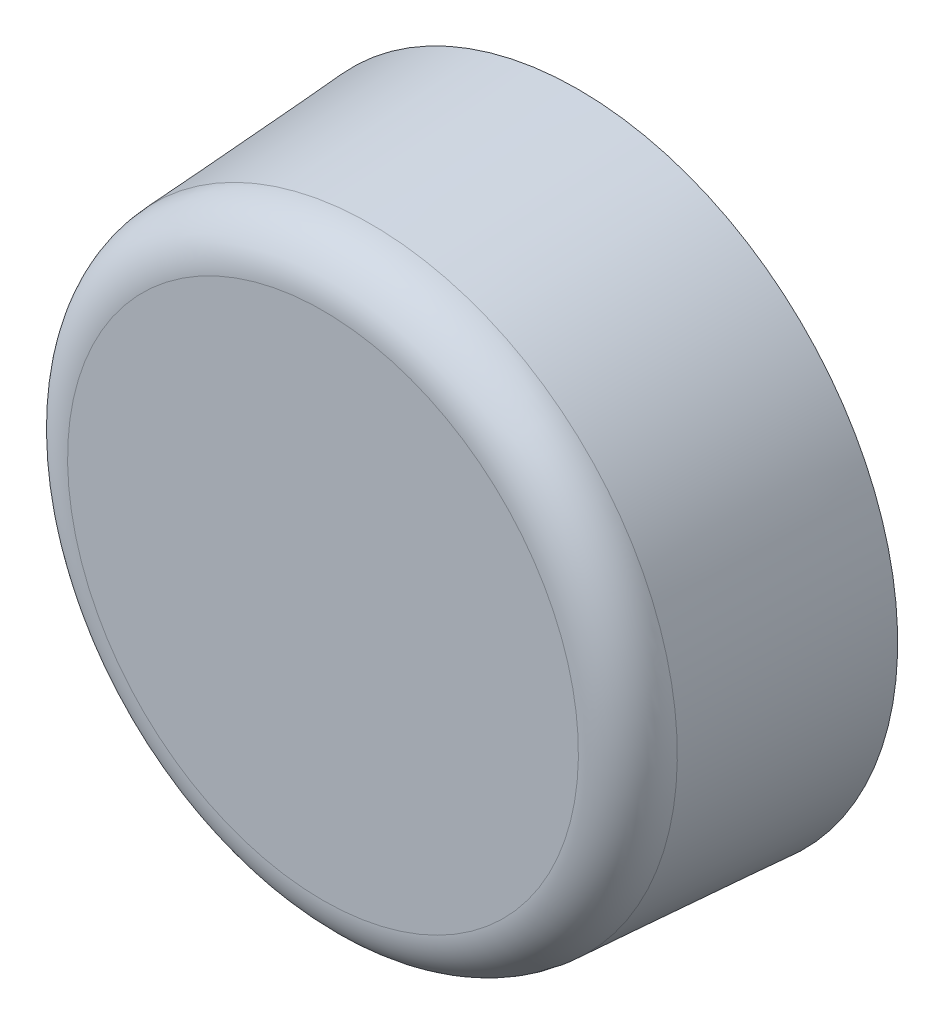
ISO-10303-21;
HEADER;
FILE_DESCRIPTION(('STEP AP214'),'2;1');
FILE_NAME('part.step','',(''),(''),'','','');
FILE_SCHEMA(('AUTOMOTIVE_DESIGN { 1 0 10303 214 1 1 1 1 }'));
ENDSEC;
DATA;
#1=APPLICATION_CONTEXT('core data for automotive mechanical design processes');
#2=APPLICATION_PROTOCOL_DEFINITION('international standard','automotive_design',2000,#1);
#3=PRODUCT_CONTEXT('',#1,'mechanical');
#4=PRODUCT('Part','Part','',(#3));
#5=PRODUCT_RELATED_PRODUCT_CATEGORY('part','',(#4));
#6=PRODUCT_DEFINITION_FORMATION('','',#4);
#7=PRODUCT_DEFINITION_CONTEXT('part definition',#1,'design');
#8=PRODUCT_DEFINITION('design','',#6,#7);
#9=PRODUCT_DEFINITION_SHAPE('','',#8);
#10=(LENGTH_UNIT() NAMED_UNIT(*) SI_UNIT(.MILLI.,.METRE.));
#11=(NAMED_UNIT(*) PLANE_ANGLE_UNIT() SI_UNIT($,.RADIAN.));
#12=(NAMED_UNIT(*) SI_UNIT($,.STERADIAN.) SOLID_ANGLE_UNIT());
#13=UNCERTAINTY_MEASURE_WITH_UNIT(LENGTH_MEASURE(1.E-05),#10,'distance_accuracy_value','');
#14=(GEOMETRIC_REPRESENTATION_CONTEXT(3) GLOBAL_UNCERTAINTY_ASSIGNED_CONTEXT((#13)) GLOBAL_UNIT_ASSIGNED_CONTEXT((#10,
#11,#12)) REPRESENTATION_CONTEXT('',''));
#15=CARTESIAN_POINT('',(0.,0.,0.));
#16=DIRECTION('',(0.,0.,1.));
#17=DIRECTION('',(1.,0.,0.));
#18=AXIS2_PLACEMENT_3D('',#15,#16,#17);
#19=CARTESIAN_POINT('',(0.,0.,20.));
#20=DIRECTION('',(0.,0.,1.));
#21=DIRECTION('',(0.,-1.,0.));
#22=AXIS2_PLACEMENT_3D('',#19,#20,#21);
#23=CYLINDRICAL_SURFACE('',#22,22.5);
#24=CARTESIAN_POINT('',(0.,0.,0.));
#25=DIRECTION('',(0.,0.,1.));
#26=DIRECTION('',(0.,-1.,0.));
#27=AXIS2_PLACEMENT_3D('',#24,#25,#26);
#28=CIRCLE('',#27,22.5);
#29=CARTESIAN_POINT('',(0.,-22.5,0.));
#30=VERTEX_POINT('',#29);
#31=EDGE_CURVE('E8',#30,#30,#28,.T.);
#32=ORIENTED_EDGE('',*,*,#31,.F.);
#33=EDGE_LOOP('',(#32));
#34=FACE_BOUND('',#33,.T.);
#35=CARTESIAN_POINT('',(0.,0.,0.0500000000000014));
#36=DIRECTION('',(0.,0.,1.));
#37=DIRECTION('',(0.,-1.,0.));
#38=AXIS2_PLACEMENT_3D('',#35,#36,#37);
#39=CIRCLE('',#38,22.5);
#40=CARTESIAN_POINT('',(0.,-22.5,0.0500000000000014));
#41=VERTEX_POINT('',#40);
#42=EDGE_CURVE('E34',#41,#41,#39,.T.);
#43=ORIENTED_EDGE('',*,*,#42,.T.);
#44=EDGE_LOOP('',(#43));
#45=FACE_BOUND('',#44,.T.);
#46=ADVANCED_FACE('F12',(#34,#45),#23,.F.);
#47=CARTESIAN_POINT('',(22.5,0.,0.));
#48=DIRECTION('',(0.,0.,1.));
#49=DIRECTION('',(0.,-1.,0.));
#50=AXIS2_PLACEMENT_3D('',#47,#48,#49);
#51=PLANE('',#50);
#52=CARTESIAN_POINT('',(0.,0.,0.));
#53=DIRECTION('',(0.,0.,1.));
#54=DIRECTION('',(0.,-1.,0.));
#55=AXIS2_PLACEMENT_3D('',#52,#53,#54);
#56=CIRCLE('',#55,25.);
#57=CARTESIAN_POINT('',(0.,-25.,0.));
#58=VERTEX_POINT('',#57);
#59=EDGE_CURVE('E18',#58,#58,#56,.T.);
#60=ORIENTED_EDGE('',*,*,#59,.F.);
#61=EDGE_LOOP('',(#60));
#62=FACE_BOUND('',#61,.T.);
#63=ORIENTED_EDGE('',*,*,#31,.T.);
#64=EDGE_LOOP('',(#63));
#65=FACE_BOUND('',#64,.T.);
#66=ADVANCED_FACE('F70',(#62,#65),#51,.F.);
#67=CARTESIAN_POINT('',(0.,0.,0.));
#68=DIRECTION('',(0.,0.,-1.));
#69=DIRECTION('',(0.,1.,0.));
#70=AXIS2_PLACEMENT_3D('',#67,#68,#69);
#71=CONICAL_SURFACE('',#70,25.,0.0619403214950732);
#72=CARTESIAN_POINT('',(0.,0.,16.2476028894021));
#73=DIRECTION('',(0.,0.,1.));
#74=DIRECTION('',(0.,-1.,0.));
#75=AXIS2_PLACEMENT_3D('',#72,#73,#74);
#76=CIRCLE('',#75,23.9923292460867);
#77=CARTESIAN_POINT('',(0.,-23.9923292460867,16.2476028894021));
#78=VERTEX_POINT('',#77);
#79=EDGE_CURVE('E22',#78,#78,#76,.T.);
#80=ORIENTED_EDGE('',*,*,#79,.F.);
#81=EDGE_LOOP('',(#80));
#82=FACE_BOUND('',#81,.T.);
#83=ORIENTED_EDGE('',*,*,#59,.T.);
#84=EDGE_LOOP('',(#83));
#85=FACE_BOUND('',#84,.T.);
#86=ADVANCED_FACE('F75',(#82,#85),#71,.T.);
#87=CARTESIAN_POINT('',(0.,0.,16.));
#88=DIRECTION('',(0.,0.,1.));
#89=DIRECTION('',(0.,-1.,0.));
#90=AXIS2_PLACEMENT_3D('',#87,#88,#89);
#91=TOROIDAL_SURFACE('',#90,20.,4.);
#92=ORIENTED_EDGE('',*,*,#79,.T.);
#93=EDGE_LOOP('',(#92));
#94=FACE_BOUND('',#93,.T.);
#95=CARTESIAN_POINT('',(0.,0.,20.));
#96=DIRECTION('',(0.,0.,1.));
#97=DIRECTION('',(0.,-1.,0.));
#98=AXIS2_PLACEMENT_3D('',#95,#96,#97);
#99=CIRCLE('',#98,20.);
#100=CARTESIAN_POINT('',(0.,-20.,20.));
#101=VERTEX_POINT('',#100);
#102=EDGE_CURVE('E26',#101,#101,#99,.T.);
#103=ORIENTED_EDGE('',*,*,#102,.F.);
#104=EDGE_LOOP('',(#103));
#105=FACE_BOUND('',#104,.T.);
#106=ADVANCED_FACE('F65',(#94,#105),#91,.T.);
#107=CARTESIAN_POINT('',(20.,0.,20.));
#108=DIRECTION('',(0.,0.,-1.));
#109=DIRECTION('',(0.,1.,0.));
#110=AXIS2_PLACEMENT_3D('',#107,#108,#109);
#111=PLANE('',#110);
#112=ORIENTED_EDGE('',*,*,#102,.T.);
#113=EDGE_LOOP('',(#112));
#114=FACE_BOUND('',#113,.T.);
#115=ADVANCED_FACE('F55',(#114),#111,.F.);
#116=CARTESIAN_POINT('',(0.,0.,0.));
#117=DIRECTION('',(0.,0.,1.));
#118=DIRECTION('',(0.,-1.,0.));
#119=AXIS2_PLACEMENT_3D('',#116,#117,#118);
#120=PLANE('',#119);
#121=CARTESIAN_POINT('',(0.,0.,0.));
#122=DIRECTION('',(0.,0.,1.));
#123=DIRECTION('',(0.,-1.,0.));
#124=AXIS2_PLACEMENT_3D('',#121,#122,#123);
#125=CIRCLE('',#124,22.45);
#126=CARTESIAN_POINT('',(0.,-22.45,0.));
#127=VERTEX_POINT('',#126);
#128=EDGE_CURVE('E31',#127,#127,#125,.T.);
#129=ORIENTED_EDGE('',*,*,#128,.F.);
#130=EDGE_LOOP('',(#129));
#131=FACE_BOUND('',#130,.T.);
#132=CARTESIAN_POINT('',(0.,0.,0.));
#133=DIRECTION('',(0.,0.,-1.));
#134=DIRECTION('',(0.,1.,0.));
#135=AXIS2_PLACEMENT_3D('',#132,#133,#134);
#136=CIRCLE('',#135,5.);
#137=CARTESIAN_POINT('',(0.,5.,0.));
#138=VERTEX_POINT('',#137);
#139=EDGE_CURVE('E38',#138,#138,#136,.T.);
#140=ORIENTED_EDGE('',*,*,#139,.F.);
#141=EDGE_LOOP('',(#140));
#142=FACE_BOUND('',#141,.T.);
#143=ADVANCED_FACE('F53',(#131,#142),#120,.F.);
#144=CARTESIAN_POINT('',(0.,0.,0.));
#145=DIRECTION('',(0.,0.,1.));
#146=DIRECTION('',(0.,-1.,0.));
#147=AXIS2_PLACEMENT_3D('',#144,#145,#146);
#148=CONICAL_SURFACE('',#147,22.45,0.785398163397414);
#149=ORIENTED_EDGE('',*,*,#42,.F.);
#150=EDGE_LOOP('',(#149));
#151=FACE_BOUND('',#150,.T.);
#152=ORIENTED_EDGE('',*,*,#128,.T.);
#153=EDGE_LOOP('',(#152));
#154=FACE_BOUND('',#153,.T.);
#155=ADVANCED_FACE('F49',(#151,#154),#148,.T.);
#156=CARTESIAN_POINT('',(0.,0.,10.));
#157=DIRECTION('',(0.,0.,-1.));
#158=DIRECTION('',(0.,1.,0.));
#159=AXIS2_PLACEMENT_3D('',#156,#157,#158);
#160=CYLINDRICAL_SURFACE('',#159,5.);
#161=CARTESIAN_POINT('',(0.,0.,10.));
#162=DIRECTION('',(0.,0.,-1.));
#163=DIRECTION('',(0.,1.,0.));
#164=AXIS2_PLACEMENT_3D('',#161,#162,#163);
#165=CIRCLE('',#164,5.);
#166=CARTESIAN_POINT('',(0.,5.,10.));
#167=VERTEX_POINT('',#166);
#168=EDGE_CURVE('E37',#167,#167,#165,.T.);
#169=ORIENTED_EDGE('',*,*,#168,.F.);
#170=EDGE_LOOP('',(#169));
#171=FACE_BOUND('',#170,.T.);
#172=ORIENTED_EDGE('',*,*,#139,.T.);
#173=EDGE_LOOP('',(#172));
#174=FACE_BOUND('',#173,.T.);
#175=ADVANCED_FACE('F46',(#171,#174),#160,.F.);
#176=CARTESIAN_POINT('',(0.,0.,10.));
#177=DIRECTION('',(0.,0.,-1.));
#178=DIRECTION('',(0.,1.,0.));
#179=AXIS2_PLACEMENT_3D('',#176,#177,#178);
#180=PLANE('',#179);
#181=ORIENTED_EDGE('',*,*,#168,.T.);
#182=EDGE_LOOP('',(#181));
#183=FACE_BOUND('',#182,.T.);
#184=ADVANCED_FACE('F44',(#183),#180,.T.);
#185=CLOSED_SHELL('',(#46,#66,#86,#106,#115,#143,#155,#175,#184));
#186=MANIFOLD_SOLID_BREP('B1',#185);
#187=ADVANCED_BREP_SHAPE_REPRESENTATION('',(#18,#186),#14);
#188=SHAPE_DEFINITION_REPRESENTATION(#9,#187);
ENDSEC;
END-ISO-10303-21;
